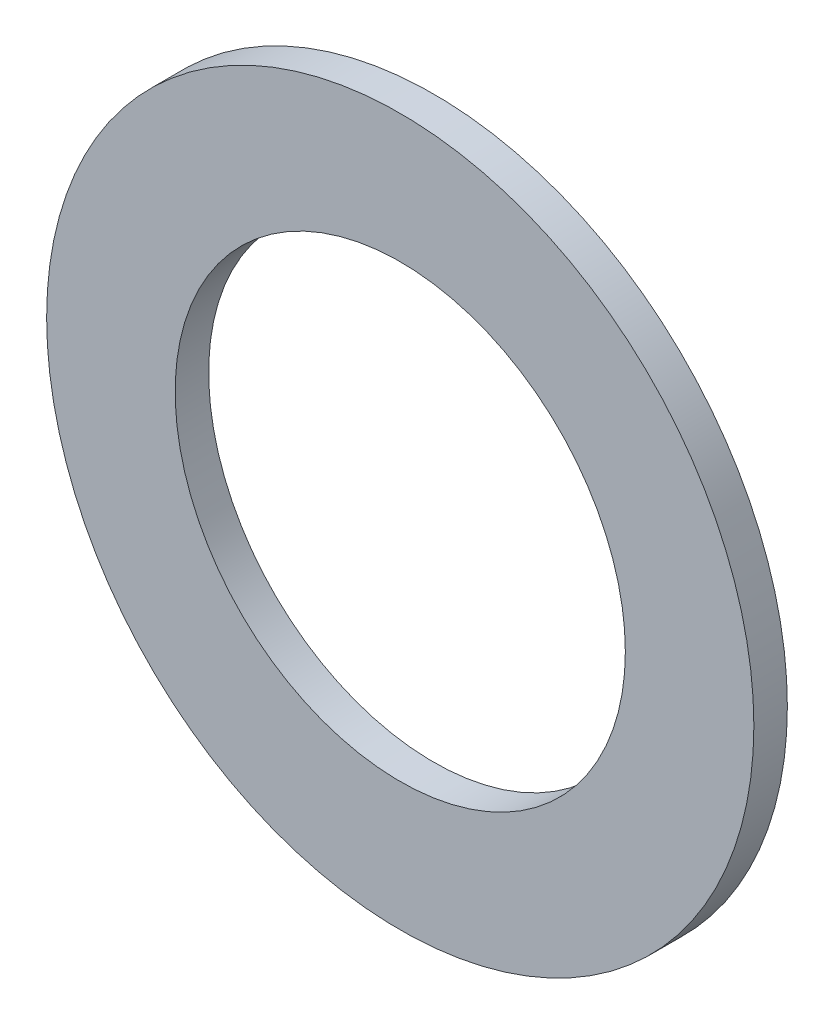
ISO-10303-21;
HEADER;
FILE_DESCRIPTION(('STEP AP214'),'2;1');
FILE_NAME('part.step','',(''),(''),'','','');
FILE_SCHEMA(('AUTOMOTIVE_DESIGN { 1 0 10303 214 1 1 1 1 }'));
ENDSEC;
DATA;
#1=APPLICATION_CONTEXT('core data for automotive mechanical design processes');
#2=APPLICATION_PROTOCOL_DEFINITION('international standard','automotive_design',2000,#1);
#3=PRODUCT_CONTEXT('',#1,'mechanical');
#4=PRODUCT('Part','Part','',(#3));
#5=PRODUCT_RELATED_PRODUCT_CATEGORY('part','',(#4));
#6=PRODUCT_DEFINITION_FORMATION('','',#4);
#7=PRODUCT_DEFINITION_CONTEXT('part definition',#1,'design');
#8=PRODUCT_DEFINITION('design','',#6,#7);
#9=PRODUCT_DEFINITION_SHAPE('','',#8);
#10=(LENGTH_UNIT() NAMED_UNIT(*) SI_UNIT(.MILLI.,.METRE.));
#11=(NAMED_UNIT(*) PLANE_ANGLE_UNIT() SI_UNIT($,.RADIAN.));
#12=(NAMED_UNIT(*) SI_UNIT($,.STERADIAN.) SOLID_ANGLE_UNIT());
#13=UNCERTAINTY_MEASURE_WITH_UNIT(LENGTH_MEASURE(1.E-05),#10,'distance_accuracy_value','');
#14=(GEOMETRIC_REPRESENTATION_CONTEXT(3) GLOBAL_UNCERTAINTY_ASSIGNED_CONTEXT((#13)) GLOBAL_UNIT_ASSIGNED_CONTEXT((#10,
#11,#12)) REPRESENTATION_CONTEXT('',''));
#15=CARTESIAN_POINT('',(0.,0.,0.));
#16=DIRECTION('',(0.,0.,1.));
#17=DIRECTION('',(1.,0.,0.));
#18=AXIS2_PLACEMENT_3D('',#15,#16,#17);
#19=CARTESIAN_POINT('',(94.6294110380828,484.73239359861,-1.));
#20=DIRECTION('',(0.,0.,1.));
#21=DIRECTION('',(1.,0.,0.));
#22=AXIS2_PLACEMENT_3D('',#19,#20,#21);
#23=CYLINDRICAL_SURFACE('',#22,10.5567447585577);
#24=CARTESIAN_POINT('',(94.6294110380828,484.73239359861,-1.));
#25=DIRECTION('',(0.,0.,1.));
#26=DIRECTION('',(1.,0.,0.));
#27=AXIS2_PLACEMENT_3D('',#24,#25,#26);
#28=CIRCLE('',#27,10.5567447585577);
#29=CARTESIAN_POINT('',(105.18615579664,484.73239359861,-1.));
#30=VERTEX_POINT('',#29);
#31=EDGE_CURVE('E10',#30,#30,#28,.T.);
#32=ORIENTED_EDGE('',*,*,#31,.T.);
#33=EDGE_LOOP('',(#32));
#34=FACE_BOUND('',#33,.T.);
#35=CARTESIAN_POINT('',(94.6294110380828,484.73239359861,0.));
#36=DIRECTION('',(0.,0.,1.));
#37=DIRECTION('',(1.,0.,0.));
#38=AXIS2_PLACEMENT_3D('',#35,#36,#37);
#39=CIRCLE('',#38,10.5567447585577);
#40=CARTESIAN_POINT('',(105.18615579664,484.73239359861,0.));
#41=VERTEX_POINT('',#40);
#42=EDGE_CURVE('E36',#41,#41,#39,.T.);
#43=ORIENTED_EDGE('',*,*,#42,.F.);
#44=EDGE_LOOP('',(#43));
#45=FACE_BOUND('',#44,.T.);
#46=ADVANCED_FACE('F30',(#34,#45),#23,.T.);
#47=CARTESIAN_POINT('',(94.6294110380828,484.73239359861,-1.));
#48=DIRECTION('',(0.,0.,1.));
#49=DIRECTION('',(1.,0.,0.));
#50=AXIS2_PLACEMENT_3D('',#47,#48,#49);
#51=PLANE('',#50);
#52=CARTESIAN_POINT('',(94.6294110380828,484.73239359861,-1.));
#53=DIRECTION('',(0.,0.,1.));
#54=DIRECTION('',(1.,0.,0.));
#55=AXIS2_PLACEMENT_3D('',#52,#53,#54);
#56=CIRCLE('',#55,6.71989772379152);
#57=CARTESIAN_POINT('',(101.349308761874,484.73239359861,-1.));
#58=VERTEX_POINT('',#57);
#59=EDGE_CURVE('E40',#58,#58,#56,.T.);
#60=ORIENTED_EDGE('',*,*,#59,.T.);
#61=EDGE_LOOP('',(#60));
#62=FACE_BOUND('',#61,.T.);
#63=ORIENTED_EDGE('',*,*,#31,.F.);
#64=EDGE_LOOP('',(#63));
#65=FACE_BOUND('',#64,.T.);
#66=ADVANCED_FACE('F54',(#62,#65),#51,.F.);
#67=CARTESIAN_POINT('',(94.6294110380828,484.73239359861,0.));
#68=DIRECTION('',(0.,0.,1.));
#69=DIRECTION('',(1.,0.,0.));
#70=AXIS2_PLACEMENT_3D('',#67,#68,#69);
#71=PLANE('',#70);
#72=CARTESIAN_POINT('',(94.6294110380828,484.73239359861,0.));
#73=DIRECTION('',(0.,0.,1.));
#74=DIRECTION('',(1.,0.,0.));
#75=AXIS2_PLACEMENT_3D('',#72,#73,#74);
#76=CIRCLE('',#75,6.71989772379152);
#77=CARTESIAN_POINT('',(101.349308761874,484.73239359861,0.));
#78=VERTEX_POINT('',#77);
#79=EDGE_CURVE('E44',#78,#78,#76,.T.);
#80=ORIENTED_EDGE('',*,*,#79,.F.);
#81=EDGE_LOOP('',(#80));
#82=FACE_BOUND('',#81,.T.);
#83=ORIENTED_EDGE('',*,*,#42,.T.);
#84=EDGE_LOOP('',(#83));
#85=FACE_BOUND('',#84,.T.);
#86=ADVANCED_FACE('F52',(#82,#85),#71,.T.);
#87=CARTESIAN_POINT('',(94.6294110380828,484.73239359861,-1.));
#88=DIRECTION('',(0.,0.,1.));
#89=DIRECTION('',(1.,0.,0.));
#90=AXIS2_PLACEMENT_3D('',#87,#88,#89);
#91=CYLINDRICAL_SURFACE('',#90,6.71989772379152);
#92=ORIENTED_EDGE('',*,*,#59,.F.);
#93=EDGE_LOOP('',(#92));
#94=FACE_BOUND('',#93,.T.);
#95=ORIENTED_EDGE('',*,*,#79,.T.);
#96=EDGE_LOOP('',(#95));
#97=FACE_BOUND('',#96,.T.);
#98=ADVANCED_FACE('F50',(#94,#97),#91,.F.);
#99=CLOSED_SHELL('',(#46,#66,#86,#98));
#100=MANIFOLD_SOLID_BREP('B2',#99);
#101=ADVANCED_BREP_SHAPE_REPRESENTATION('',(#18,#100),#14);
#102=SHAPE_DEFINITION_REPRESENTATION(#9,#101);
ENDSEC;
END-ISO-10303-21;
